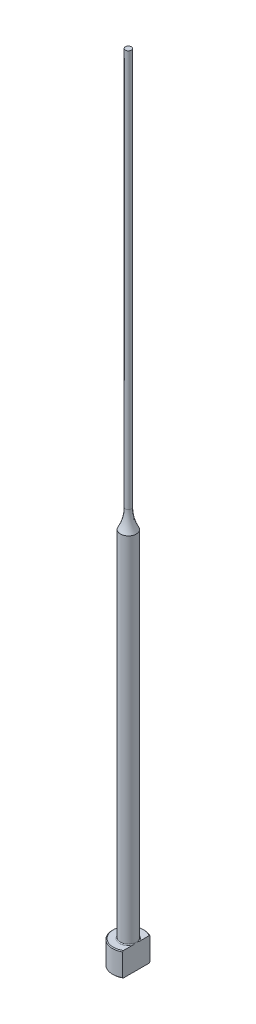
ISO-10303-21;
HEADER;
FILE_DESCRIPTION(('STEP AP214'),'2;1');
FILE_NAME('part.step','',(''),(''),'','','');
FILE_SCHEMA(('AUTOMOTIVE_DESIGN { 1 0 10303 214 1 1 1 1 }'));
ENDSEC;
DATA;
#1=APPLICATION_CONTEXT('core data for automotive mechanical design processes');
#2=APPLICATION_PROTOCOL_DEFINITION('international standard','automotive_design',2000,#1);
#3=PRODUCT_CONTEXT('',#1,'mechanical');
#4=PRODUCT('Part','Part','',(#3));
#5=PRODUCT_RELATED_PRODUCT_CATEGORY('part','',(#4));
#6=PRODUCT_DEFINITION_FORMATION('','',#4);
#7=PRODUCT_DEFINITION_CONTEXT('part definition',#1,'design');
#8=PRODUCT_DEFINITION('design','',#6,#7);
#9=PRODUCT_DEFINITION_SHAPE('','',#8);
#10=(LENGTH_UNIT() NAMED_UNIT(*) SI_UNIT(.MILLI.,.METRE.));
#11=(NAMED_UNIT(*) PLANE_ANGLE_UNIT() SI_UNIT($,.RADIAN.));
#12=(NAMED_UNIT(*) SI_UNIT($,.STERADIAN.) SOLID_ANGLE_UNIT());
#13=UNCERTAINTY_MEASURE_WITH_UNIT(LENGTH_MEASURE(1.E-05),#10,'distance_accuracy_value','');
#14=(GEOMETRIC_REPRESENTATION_CONTEXT(3) GLOBAL_UNCERTAINTY_ASSIGNED_CONTEXT((#13)) GLOBAL_UNIT_ASSIGNED_CONTEXT((#10,
#11,#12)) REPRESENTATION_CONTEXT('',''));
#15=CARTESIAN_POINT('',(0.,0.,0.));
#16=DIRECTION('',(0.,0.,1.));
#17=DIRECTION('',(1.,0.,0.));
#18=AXIS2_PLACEMENT_3D('',#15,#16,#17);
#19=CARTESIAN_POINT('',(-3.99999999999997,6.,0.));
#20=DIRECTION('',(0.,1.,0.));
#21=DIRECTION('',(0.,0.,1.));
#22=AXIS2_PLACEMENT_3D('',#19,#20,#21);
#23=PLANE('',#22);
#24=CARTESIAN_POINT('',(0.,6.,0.));
#25=DIRECTION('',(0.,1.,0.));
#26=DIRECTION('',(0.,0.,1.));
#27=AXIS2_PLACEMENT_3D('',#24,#25,#26);
#28=CIRCLE('',#27,3.80000000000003);
#29=CARTESIAN_POINT('',(1.99999999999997,6.,-3.23109888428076));
#30=VERTEX_POINT('',#29);
#31=CARTESIAN_POINT('',(1.99999999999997,6.,3.23109888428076));
#32=VERTEX_POINT('',#31);
#33=EDGE_CURVE('E187',#30,#32,#28,.T.);
#34=ORIENTED_EDGE('',*,*,#33,.T.);
#35=DIRECTION('',(0.,0.,-1.));
#36=VECTOR('',#35,1.);
#37=CARTESIAN_POINT('',(1.99999999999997,6.,0.));
#38=LINE('',#37,#36);
#39=CARTESIAN_POINT('',(1.99999999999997,5.99999999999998,0.916515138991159));
#40=VERTEX_POINT('',#39);
#41=EDGE_CURVE('E57',#32,#40,#38,.T.);
#42=ORIENTED_EDGE('',*,*,#41,.T.);
#43=CARTESIAN_POINT('',(0.,6.,0.));
#44=DIRECTION('',(0.,1.,0.));
#45=DIRECTION('',(0.,0.,1.));
#46=AXIS2_PLACEMENT_3D('',#43,#44,#45);
#47=CIRCLE('',#46,2.19999999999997);
#48=CARTESIAN_POINT('',(1.99999999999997,5.99999999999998,-0.916515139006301));
#49=VERTEX_POINT('',#48);
#50=EDGE_CURVE('E108',#40,#49,#47,.F.);
#51=ORIENTED_EDGE('',*,*,#50,.T.);
#52=EDGE_CURVE('E137',#49,#30,#38,.T.);
#53=ORIENTED_EDGE('',*,*,#52,.T.);
#54=EDGE_LOOP('',(#34,#42,#51,#53));
#55=FACE_BOUND('',#54,.T.);
#56=ADVANCED_FACE('F32',(#55),#23,.T.);
#57=CARTESIAN_POINT('',(0.,259.958771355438,0.));
#58=DIRECTION('',(0.,1.,0.));
#59=DIRECTION('',(0.,0.,1.));
#60=AXIS2_PLACEMENT_3D('',#57,#58,#59);
#61=CYLINDRICAL_SURFACE('',#60,3.99999999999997);
#62=CARTESIAN_POINT('',(0.,5.80000000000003,0.));
#63=DIRECTION('',(0.,1.,0.));
#64=DIRECTION('',(0.,0.,1.));
#65=AXIS2_PLACEMENT_3D('',#62,#63,#64);
#66=CIRCLE('',#65,3.99999999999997);
#67=CARTESIAN_POINT('',(1.99999999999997,5.80000000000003,3.46410161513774));
#68=VERTEX_POINT('',#67);
#69=CARTESIAN_POINT('',(1.99999999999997,5.80000000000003,-3.46410161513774));
#70=VERTEX_POINT('',#69);
#71=EDGE_CURVE('E105',#68,#70,#66,.F.);
#72=ORIENTED_EDGE('',*,*,#71,.T.);
#73=DIRECTION('',(0.,-1.,0.));
#74=VECTOR('',#73,1.);
#75=CARTESIAN_POINT('',(1.99999999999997,200.,-3.46410161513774));
#76=LINE('',#75,#74);
#77=CARTESIAN_POINT('',(1.99999999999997,0.199999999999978,-3.46410161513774));
#78=VERTEX_POINT('',#77);
#79=EDGE_CURVE('E193',#70,#78,#76,.T.);
#80=ORIENTED_EDGE('',*,*,#79,.T.);
#81=CARTESIAN_POINT('',(0.,0.199999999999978,0.));
#82=DIRECTION('',(0.,-1.,0.));
#83=DIRECTION('',(0.,0.,-1.));
#84=AXIS2_PLACEMENT_3D('',#81,#82,#83);
#85=CIRCLE('',#84,3.99999999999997);
#86=CARTESIAN_POINT('',(1.99999999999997,0.199999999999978,3.46410161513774));
#87=VERTEX_POINT('',#86);
#88=EDGE_CURVE('E100',#78,#87,#85,.F.);
#89=ORIENTED_EDGE('',*,*,#88,.T.);
#90=DIRECTION('',(0.,-1.,0.));
#91=VECTOR('',#90,1.);
#92=CARTESIAN_POINT('',(1.99999999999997,200.,3.46410161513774));
#93=LINE('',#92,#91);
#94=EDGE_CURVE('E93',#68,#87,#93,.T.);
#95=ORIENTED_EDGE('',*,*,#94,.F.);
#96=EDGE_LOOP('',(#72,#80,#89,#95));
#97=FACE_BOUND('',#96,.T.);
#98=ADVANCED_FACE('F158',(#97),#61,.T.);
#99=CARTESIAN_POINT('',(0.,0.,0.));
#100=DIRECTION('',(0.,-1.,0.));
#101=DIRECTION('',(0.,0.,-1.));
#102=AXIS2_PLACEMENT_3D('',#99,#100,#101);
#103=PLANE('',#102);
#104=CARTESIAN_POINT('',(0.,0.,0.));
#105=DIRECTION('',(0.,-1.,0.));
#106=DIRECTION('',(0.,0.,-1.));
#107=AXIS2_PLACEMENT_3D('',#104,#105,#106);
#108=CIRCLE('',#107,3.79999999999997);
#109=CARTESIAN_POINT('',(1.99999999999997,0.,3.23109888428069));
#110=VERTEX_POINT('',#109);
#111=CARTESIAN_POINT('',(1.99999999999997,0.,-3.23109888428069));
#112=VERTEX_POINT('',#111);
#113=EDGE_CURVE('E98',#110,#112,#108,.T.);
#114=ORIENTED_EDGE('',*,*,#113,.T.);
#115=DIRECTION('',(0.,0.,1.));
#116=VECTOR('',#115,1.);
#117=CARTESIAN_POINT('',(1.99999999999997,0.,3.46410161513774));
#118=LINE('',#117,#116);
#119=EDGE_CURVE('E83',#112,#110,#118,.T.);
#120=ORIENTED_EDGE('',*,*,#119,.T.);
#121=EDGE_LOOP('',(#114,#120));
#122=FACE_BOUND('',#121,.T.);
#123=ADVANCED_FACE('F103',(#122),#103,.T.);
#124=CARTESIAN_POINT('',(0.,6.00000000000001,0.));
#125=DIRECTION('',(0.,-1.,0.));
#126=DIRECTION('',(0.,0.,-1.));
#127=AXIS2_PLACEMENT_3D('',#124,#125,#126);
#128=CONICAL_SURFACE('',#127,3.80000000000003,0.785398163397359);
#129=ORIENTED_EDGE('',*,*,#71,.F.);
#130=CARTESIAN_POINT('',(1.99999999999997,1.91904532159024,7.62295524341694));
#131=CARTESIAN_POINT('',(1.99999999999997,2.08611243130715,7.4502239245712));
#132=CARTESIAN_POINT('',(1.99999999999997,2.25300024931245,7.27731861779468));
#133=CARTESIAN_POINT('',(1.99999999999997,2.58631125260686,6.93105655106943));
#134=CARTESIAN_POINT('',(1.99999999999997,2.75273443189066,6.75769978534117));
#135=CARTESIAN_POINT('',(1.99999999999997,3.08509080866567,6.41034692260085));
#136=CARTESIAN_POINT('',(1.99999999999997,3.25102371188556,6.23635054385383));
#137=CARTESIAN_POINT('',(1.99999999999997,3.58215598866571,5.88766284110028));
#138=CARTESIAN_POINT('',(1.99999999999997,3.74735536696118,5.71297152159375));
#139=CARTESIAN_POINT('',(1.99999999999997,4.0735385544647,5.36616839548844));
#140=CARTESIAN_POINT('',(1.99999999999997,4.23454099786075,5.19407412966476));
#141=CARTESIAN_POINT('',(1.99999999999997,4.55534102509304,4.8487666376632));
#142=CARTESIAN_POINT('',(1.99999999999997,4.71513861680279,4.67555341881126));
#143=CARTESIAN_POINT('',(1.99999999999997,5.0330618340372,4.32766569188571));
#144=CARTESIAN_POINT('',(1.99999999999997,5.19118781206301,4.15299150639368));
#145=CARTESIAN_POINT('',(1.99999999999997,5.50513944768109,3.80159134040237));
#146=CARTESIAN_POINT('',(1.99999999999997,5.66096519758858,3.62486544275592));
#147=CARTESIAN_POINT('',(1.99999999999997,5.90974646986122,3.33722425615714));
#148=CARTESIAN_POINT('',(1.99999999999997,6.00376148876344,3.22722645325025));
#149=CARTESIAN_POINT('',(1.99999999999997,6.19011825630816,3.00579987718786));
#150=CARTESIAN_POINT('',(1.99999999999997,6.28245983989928,2.89437096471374));
#151=CARTESIAN_POINT('',(1.99999999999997,6.46586188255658,2.66849662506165));
#152=CARTESIAN_POINT('',(1.99999999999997,6.55689849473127,2.5540317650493));
#153=CARTESIAN_POINT('',(1.99999999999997,6.73578809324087,2.32266819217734));
#154=CARTESIAN_POINT('',(1.99999999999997,6.82364184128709,2.20577007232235));
#155=CARTESIAN_POINT('',(1.99999999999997,6.99612756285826,1.96688707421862));
#156=CARTESIAN_POINT('',(1.99999999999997,7.08069035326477,1.84485190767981));
#157=CARTESIAN_POINT('',(1.99999999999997,7.24300264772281,1.59599329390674));
#158=CARTESIAN_POINT('',(1.99999999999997,7.32074277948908,1.46916359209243));
#159=CARTESIAN_POINT('',(1.99999999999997,7.42869763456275,1.27510066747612));
#160=CARTESIAN_POINT('',(1.99999999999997,7.46305374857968,1.21018943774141));
#161=CARTESIAN_POINT('',(1.99999999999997,7.52837146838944,1.07868835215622));
#162=CARTESIAN_POINT('',(1.99999999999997,7.55933245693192,1.01209819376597));
#163=CARTESIAN_POINT('',(1.99999999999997,7.6456686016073,0.809894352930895));
#164=CARTESIAN_POINT('',(1.99999999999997,7.69478214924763,0.671360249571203));
#165=CARTESIAN_POINT('',(1.99999999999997,7.74794829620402,0.463657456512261));
#166=CARTESIAN_POINT('',(1.99999999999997,7.76205065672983,0.397033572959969));
#167=CARTESIAN_POINT('',(1.99999999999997,7.78390371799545,0.262728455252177));
#168=CARTESIAN_POINT('',(1.99999999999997,7.79165498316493,0.195047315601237));
#169=CARTESIAN_POINT('',(1.99999999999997,7.80025690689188,0.0594528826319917));
#170=CARTESIAN_POINT('',(1.99999999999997,7.80112894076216,-0.00845903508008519));
#171=CARTESIAN_POINT('',(1.99999999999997,7.79596585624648,-0.144020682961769));
#172=CARTESIAN_POINT('',(1.99999999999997,7.78993016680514,-0.211670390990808));
#173=CARTESIAN_POINT('',(1.99999999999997,7.7714536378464,-0.345483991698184));
#174=CARTESIAN_POINT('',(1.99999999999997,7.75906777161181,-0.411655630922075));
#175=CARTESIAN_POINT('',(1.99999999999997,7.7286636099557,-0.542678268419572));
#176=CARTESIAN_POINT('',(1.99999999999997,7.7106446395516,-0.607529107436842));
#177=CARTESIAN_POINT('',(1.99999999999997,7.66972939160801,-0.73606439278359));
#178=CARTESIAN_POINT('',(1.99999999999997,7.64680564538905,-0.799739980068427));
#179=CARTESIAN_POINT('',(1.99999999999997,7.59700147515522,-0.925489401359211));
#180=CARTESIAN_POINT('',(1.99999999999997,7.57012185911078,-0.987563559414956));
#181=CARTESIAN_POINT('',(1.99999999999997,7.48443518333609,-1.17209020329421));
#182=CARTESIAN_POINT('',(1.99999999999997,7.42077407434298,-1.29228210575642));
#183=CARTESIAN_POINT('',(1.99999999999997,7.28502644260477,-1.52785770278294));
#184=CARTESIAN_POINT('',(1.99999999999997,7.21292931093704,-1.64323509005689));
#185=CARTESIAN_POINT('',(1.99999999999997,7.0628151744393,-1.87069387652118));
#186=CARTESIAN_POINT('',(1.99999999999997,6.98477595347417,-1.98276048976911));
#187=CARTESIAN_POINT('',(1.99999999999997,6.82481971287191,-2.20397837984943));
#188=CARTESIAN_POINT('',(1.99999999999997,6.74290465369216,-2.31313108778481));
#189=CARTESIAN_POINT('',(1.99999999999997,6.57517222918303,-2.53068545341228));
#190=CARTESIAN_POINT('',(1.99999999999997,6.48931769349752,-2.63905831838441));
#191=CARTESIAN_POINT('',(1.99999999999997,6.31548151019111,-2.85409686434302));
#192=CARTESIAN_POINT('',(1.99999999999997,6.22749963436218,-2.96076236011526));
#193=CARTESIAN_POINT('',(1.99999999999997,6.05015030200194,-3.17249211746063));
#194=CARTESIAN_POINT('',(1.99999999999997,5.96078672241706,-3.27755963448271));
#195=CARTESIAN_POINT('',(1.99999999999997,5.78082366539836,-3.48663191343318));
#196=CARTESIAN_POINT('',(1.99999999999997,5.69022416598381,-3.59063665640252));
#197=CARTESIAN_POINT('',(1.99999999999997,5.44796733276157,-3.86612439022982));
#198=CARTESIAN_POINT('',(1.99999999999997,5.29545972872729,-4.03685912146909));
#199=CARTESIAN_POINT('',(1.99999999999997,4.98858070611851,-4.3766480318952));
#200=CARTESIAN_POINT('',(1.99999999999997,4.83420923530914,-4.54570216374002));
#201=CARTESIAN_POINT('',(1.99999999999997,4.52396102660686,-4.882716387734));
#202=CARTESIAN_POINT('',(1.99999999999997,4.36808300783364,-5.05067529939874));
#203=CARTESIAN_POINT('',(1.99999999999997,4.05530513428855,-5.38563883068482));
#204=CARTESIAN_POINT('',(1.99999999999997,3.89840527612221,-5.55264344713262));
#205=CARTESIAN_POINT('',(1.99999999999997,3.59029018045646,-5.87905385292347));
#206=CARTESIAN_POINT('',(1.99999999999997,3.43910664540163,-6.03848959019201));
#207=CARTESIAN_POINT('',(1.99999999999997,3.13616436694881,-6.3568145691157));
#208=CARTESIAN_POINT('',(1.99999999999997,2.98440562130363,-6.51570380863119));
#209=CARTESIAN_POINT('',(1.99999999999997,2.68059501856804,-6.83286192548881));
#210=CARTESIAN_POINT('',(1.99999999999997,2.52854367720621,-6.99113129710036));
#211=CARTESIAN_POINT('',(1.99999999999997,2.22406035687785,-7.30730102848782));
#212=CARTESIAN_POINT('',(1.99999999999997,2.07162838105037,-7.46520139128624));
#213=CARTESIAN_POINT('',(1.99999999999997,1.91904532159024,-7.62295524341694));
#214=B_SPLINE_CURVE_WITH_KNOTS('',3,(#130,#131,#132,#133,#134,#135,#136,#137,#138,#139,#140,
#141,#142,#143,#144,#145,#146,#147,#148,#149,#150,#151,#152,#153,#154,#155,#156,#157,#158,#159,
#160,#161,#162,#163,#164,#165,#166,#167,#168,#169,#170,#171,#172,#173,#174,#175,#176,#177,#178,
#179,#180,#181,#182,#183,#184,#185,#186,#187,#188,#189,#190,#191,#192,#193,#194,#195,#196,#197,
#198,#199,#200,#201,#202,#203,#204,#205,#206,#207,#208,#209,#210,#211,#212,#213),.UNSPECIFIED.,
.F.,.F.,(4,2,2,2,2,2,2,2,2,2,2,2,2,2,2,2,2,2,2,2,2,2,2,2,2,2,2,2,2,2,2,2,2,2,2,2,2,2,2,2,2,4),
(0.,0.720921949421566,1.4418531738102,2.16315326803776,2.88444869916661,3.59144103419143,
4.29842874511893,5.00526427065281,5.71207135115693,6.14616174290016,6.58029471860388,
7.01901494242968,7.45762947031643,7.90290456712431,8.34878206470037,8.56901415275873,
8.78928621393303,9.22814472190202,9.43219512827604,9.63622739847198,9.83962544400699,
10.0430403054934,10.244723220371,10.4464303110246,10.6492980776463,10.8521244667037,
11.2595582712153,11.6675100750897,12.0770700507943,12.4864250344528,12.9011677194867,
13.3159550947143,13.7297367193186,14.1435257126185,14.8302935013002,15.5170805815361,
16.2045145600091,16.891950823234,17.5511045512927,18.2102608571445,18.8686819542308,
19.5270976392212),.UNSPECIFIED.);
#215=EDGE_CURVE('E136',#68,#32,#214,.T.);
#216=ORIENTED_EDGE('',*,*,#215,.T.);
#217=ORIENTED_EDGE('',*,*,#33,.F.);
#218=EDGE_CURVE('E128',#30,#70,#214,.T.);
#219=ORIENTED_EDGE('',*,*,#218,.T.);
#220=EDGE_LOOP('',(#129,#216,#217,#219));
#221=FACE_BOUND('',#220,.T.);
#222=ADVANCED_FACE('F144',(#221),#128,.T.);
#223=CARTESIAN_POINT('',(0.,0.199999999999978,0.));
#224=DIRECTION('',(0.,1.,0.));
#225=DIRECTION('',(0.,0.,1.));
#226=AXIS2_PLACEMENT_3D('',#223,#224,#225);
#227=CONICAL_SURFACE('',#226,3.99999999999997,0.785398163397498);
#228=ORIENTED_EDGE('',*,*,#88,.F.);
#229=CARTESIAN_POINT('',(1.99999999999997,4.08095467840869,-7.62295524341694));
#230=CARTESIAN_POINT('',(1.99999999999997,3.91388756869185,-7.45022392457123));
#231=CARTESIAN_POINT('',(1.99999999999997,3.74699975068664,-7.27731861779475));
#232=CARTESIAN_POINT('',(1.99999999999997,3.41368874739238,-6.93105655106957));
#233=CARTESIAN_POINT('',(1.99999999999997,3.24726556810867,-6.75769978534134));
#234=CARTESIAN_POINT('',(1.99999999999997,2.91490919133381,-6.4103469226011));
#235=CARTESIAN_POINT('',(1.99999999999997,2.748976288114,-6.23635054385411));
#236=CARTESIAN_POINT('',(1.99999999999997,2.41784401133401,-5.88766284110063));
#237=CARTESIAN_POINT('',(1.99999999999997,2.25264463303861,-5.71297152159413));
#238=CARTESIAN_POINT('',(1.99999999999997,1.92646144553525,-5.36616839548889));
#239=CARTESIAN_POINT('',(1.99999999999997,1.76545900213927,-5.19407412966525));
#240=CARTESIAN_POINT('',(1.99999999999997,1.44465897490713,-4.84876663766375));
#241=CARTESIAN_POINT('',(1.99999999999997,1.28486138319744,-4.67555341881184));
#242=CARTESIAN_POINT('',(1.99999999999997,0.966938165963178,-4.32766569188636));
#243=CARTESIAN_POINT('',(1.99999999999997,0.80881218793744,-4.15299150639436));
#244=CARTESIAN_POINT('',(1.99999999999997,0.494860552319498,-3.80159134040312));
#245=CARTESIAN_POINT('',(1.99999999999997,0.339034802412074,-3.62486544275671));
#246=CARTESIAN_POINT('',(1.99999999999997,0.0902535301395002,-3.33722425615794));
#247=CARTESIAN_POINT('',(1.99999999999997,-0.00376148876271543,-3.22722645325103));
#248=CARTESIAN_POINT('',(1.99999999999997,-0.190118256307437,-3.00579987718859));
#249=CARTESIAN_POINT('',(1.99999999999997,-0.282459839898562,-2.89437096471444));
#250=CARTESIAN_POINT('',(1.99999999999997,-0.465861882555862,-2.66849662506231));
#251=CARTESIAN_POINT('',(1.99999999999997,-0.556898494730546,-2.55403176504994));
#252=CARTESIAN_POINT('',(1.99999999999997,-0.735788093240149,-2.32266819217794));
#253=CARTESIAN_POINT('',(1.99999999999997,-0.823641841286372,-2.20577007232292));
#254=CARTESIAN_POINT('',(1.99999999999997,-0.996127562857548,-1.96688707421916));
#255=CARTESIAN_POINT('',(1.99999999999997,-1.08069035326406,-1.84485190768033));
#256=CARTESIAN_POINT('',(1.99999999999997,-1.24300264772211,-1.59599329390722));
#257=CARTESIAN_POINT('',(1.99999999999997,-1.32074277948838,-1.46916359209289));
#258=CARTESIAN_POINT('',(1.99999999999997,-1.42869763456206,-1.27510066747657));
#259=CARTESIAN_POINT('',(1.99999999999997,-1.46305374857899,-1.21018943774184));
#260=CARTESIAN_POINT('',(1.99999999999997,-1.52837146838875,-1.07868835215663));
#261=CARTESIAN_POINT('',(1.99999999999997,-1.55933245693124,-1.01209819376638));
#262=CARTESIAN_POINT('',(1.99999999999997,-1.64566860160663,-0.809894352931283));
#263=CARTESIAN_POINT('',(1.99999999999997,-1.69478214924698,-0.671360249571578));
#264=CARTESIAN_POINT('',(1.99999999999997,-1.7479482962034,-0.463657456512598));
#265=CARTESIAN_POINT('',(1.99999999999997,-1.76205065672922,-0.397033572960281));
#266=CARTESIAN_POINT('',(1.99999999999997,-1.78390371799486,-0.262728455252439));
#267=CARTESIAN_POINT('',(1.99999999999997,-1.79165498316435,-0.195047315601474));
#268=CARTESIAN_POINT('',(1.99999999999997,-1.80025690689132,-0.0594528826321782));
#269=CARTESIAN_POINT('',(1.99999999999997,-1.8011289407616,0.00845903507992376));
#270=CARTESIAN_POINT('',(1.99999999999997,-1.79596585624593,0.144020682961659));
#271=CARTESIAN_POINT('',(1.99999999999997,-1.78993016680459,0.211670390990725));
#272=CARTESIAN_POINT('',(1.99999999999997,-1.77145363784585,0.345483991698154));
#273=CARTESIAN_POINT('',(1.99999999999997,-1.75906777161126,0.41165563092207));
#274=CARTESIAN_POINT('',(1.99999999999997,-1.72866360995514,0.542678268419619));
#275=CARTESIAN_POINT('',(1.99999999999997,-1.71064463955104,0.607529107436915));
#276=CARTESIAN_POINT('',(1.99999999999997,-1.66972939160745,0.736064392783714));
#277=CARTESIAN_POINT('',(1.99999999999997,-1.64680564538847,0.799739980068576));
#278=CARTESIAN_POINT('',(1.99999999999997,-1.59700147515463,0.92548940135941));
#279=CARTESIAN_POINT('',(1.99999999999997,-1.57012185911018,0.987563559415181));
#280=CARTESIAN_POINT('',(1.99999999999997,-1.48443518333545,1.17209020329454));
#281=CARTESIAN_POINT('',(1.99999999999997,-1.4207740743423,1.29228210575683));
#282=CARTESIAN_POINT('',(1.99999999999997,-1.28502644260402,1.52785770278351));
#283=CARTESIAN_POINT('',(1.99999999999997,-1.21292931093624,1.64323509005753));
#284=CARTESIAN_POINT('',(1.99999999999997,-1.06281517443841,1.87069387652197));
#285=CARTESIAN_POINT('',(1.99999999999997,-0.984775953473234,1.98276048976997));
#286=CARTESIAN_POINT('',(1.99999999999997,-0.824819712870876,2.20397837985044));
#287=CARTESIAN_POINT('',(1.99999999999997,-0.742904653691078,2.31313108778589));
#288=CARTESIAN_POINT('',(1.99999999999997,-0.575172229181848,2.5306854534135));
#289=CARTESIAN_POINT('',(1.99999999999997,-0.489317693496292,2.6390583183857));
#290=CARTESIAN_POINT('',(1.99999999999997,-0.315481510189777,2.85409686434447));
#291=CARTESIAN_POINT('',(1.99999999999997,-0.227499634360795,2.96076236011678));
#292=CARTESIAN_POINT('',(1.99999999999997,-0.0501503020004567,3.1724921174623));
#293=CARTESIAN_POINT('',(1.99999999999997,0.0392132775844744,3.27755963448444));
#294=CARTESIAN_POINT('',(1.99999999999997,0.219176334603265,3.48663191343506));
#295=CARTESIAN_POINT('',(1.99999999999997,0.309775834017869,3.59063665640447));
#296=CARTESIAN_POINT('',(1.99999999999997,0.552032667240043,3.86612439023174));
#297=CARTESIAN_POINT('',(1.99999999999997,0.704540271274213,4.03685912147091));
#298=CARTESIAN_POINT('',(1.99999999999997,1.01141929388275,4.37664803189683));
#299=CARTESIAN_POINT('',(1.99999999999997,1.16579076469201,4.54570216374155));
#300=CARTESIAN_POINT('',(1.99999999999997,1.47603897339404,4.88271638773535));
#301=CARTESIAN_POINT('',(1.99999999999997,1.63191699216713,5.05067529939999));
#302=CARTESIAN_POINT('',(1.99999999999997,1.94469486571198,5.38563883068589));
#303=CARTESIAN_POINT('',(1.99999999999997,2.10159472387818,5.5526434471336));
#304=CARTESIAN_POINT('',(1.99999999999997,2.40970981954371,5.87905385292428));
#305=CARTESIAN_POINT('',(1.99999999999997,2.56089335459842,6.03848959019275));
#306=CARTESIAN_POINT('',(1.99999999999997,2.86383563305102,6.35681456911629));
#307=CARTESIAN_POINT('',(1.99999999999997,3.01559437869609,6.5157038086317));
#308=CARTESIAN_POINT('',(1.99999999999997,3.31940498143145,6.83286192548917));
#309=CARTESIAN_POINT('',(1.99999999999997,3.47145632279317,6.99113129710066));
#310=CARTESIAN_POINT('',(1.99999999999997,3.7759396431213,7.30730102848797));
#311=CARTESIAN_POINT('',(1.99999999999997,3.92837161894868,7.46520139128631));
#312=CARTESIAN_POINT('',(1.99999999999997,4.08095467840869,7.62295524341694));
#313=B_SPLINE_CURVE_WITH_KNOTS('',3,(#229,#230,#231,#232,#233,#234,#235,#236,#237,#238,#239,
#240,#241,#242,#243,#244,#245,#246,#247,#248,#249,#250,#251,#252,#253,#254,#255,#256,#257,#258,
#259,#260,#261,#262,#263,#264,#265,#266,#267,#268,#269,#270,#271,#272,#273,#274,#275,#276,#277,
#278,#279,#280,#281,#282,#283,#284,#285,#286,#287,#288,#289,#290,#291,#292,#293,#294,#295,#296,
#297,#298,#299,#300,#301,#302,#303,#304,#305,#306,#307,#308,#309,#310,#311,#312),.UNSPECIFIED.,
.F.,.F.,(4,2,2,2,2,2,2,2,2,2,2,2,2,2,2,2,2,2,2,2,2,2,2,2,2,2,2,2,2,2,2,2,2,2,2,2,2,2,2,2,2,4),
(0.,0.720921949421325,1.44185317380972,2.16315326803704,2.88444869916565,3.59144103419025,
4.29842874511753,5.0052642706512,5.71207135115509,6.14616174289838,6.58029471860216,
7.01901494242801,7.45762947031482,7.90290456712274,8.34878206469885,8.56901415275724,
8.78928621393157,9.22814472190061,9.43219512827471,9.63622739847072,9.83962544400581,
10.0430403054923,10.24472322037,10.4464303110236,10.6492980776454,10.852124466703,
11.2595582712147,11.6675100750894,12.0770700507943,12.4864250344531,12.9011677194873,
13.3159550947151,13.7297367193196,14.1435257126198,14.8302935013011,15.5170805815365,
16.204514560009,16.8919508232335,17.5511045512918,18.2102608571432,18.8686819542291,
19.5270976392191),.UNSPECIFIED.);
#314=EDGE_CURVE('E86',#78,#112,#313,.T.);
#315=ORIENTED_EDGE('',*,*,#314,.T.);
#316=ORIENTED_EDGE('',*,*,#113,.F.);
#317=EDGE_CURVE('E89',#110,#87,#313,.T.);
#318=ORIENTED_EDGE('',*,*,#317,.T.);
#319=EDGE_LOOP('',(#228,#315,#316,#318));
#320=FACE_BOUND('',#319,.T.);
#321=ADVANCED_FACE('F97',(#320),#227,.T.);
#322=CARTESIAN_POINT('',(0.,6.19999999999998,0.));
#323=DIRECTION('',(0.,1.,0.));
#324=DIRECTION('',(0.,0.,1.));
#325=AXIS2_PLACEMENT_3D('',#322,#323,#324);
#326=TOROIDAL_SURFACE('',#325,2.19999999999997,0.2);
#327=CARTESIAN_POINT('',(1.99999999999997,6.19999999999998,0.));
#328=CARTESIAN_POINT('',(1.99999999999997,6.20000050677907,1.13930197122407E-10));
#329=CARTESIAN_POINT('',(1.99999999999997,6.20000101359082,-1.46766795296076E-07));
#330=CARTESIAN_POINT('',(1.99999999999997,6.20000197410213,-5.82067450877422E-07));
#331=CARTESIAN_POINT('',(1.99999999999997,6.20000242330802,-8.77873017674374E-07));
#332=CARTESIAN_POINT('',(1.99999999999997,6.2000033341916,-1.58424515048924E-06));
#333=CARTESIAN_POINT('',(1.99999999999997,6.20000378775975,-2.00534283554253E-06));
#334=CARTESIAN_POINT('',(1.99999999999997,6.20000462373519,-2.89558841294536E-06));
#335=CARTESIAN_POINT('',(1.99999999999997,6.20000500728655,-3.36372325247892E-06));
#336=CARTESIAN_POINT('',(1.99999999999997,6.20000636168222,-5.10887550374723E-06));
#337=CARTESIAN_POINT('',(1.99999999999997,6.20000725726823,-6.44597279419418E-06));
#338=CARTESIAN_POINT('',(1.99999999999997,6.20000879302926,-9.14926716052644E-06));
#339=CARTESIAN_POINT('',(1.99999999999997,6.20000944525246,-1.05089714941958E-05));
#340=CARTESIAN_POINT('',(1.99999999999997,6.20001204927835,-1.60555880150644E-05));
#341=CARTESIAN_POINT('',(1.99999999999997,6.20001390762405,-2.02908747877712E-05));
#342=CARTESIAN_POINT('',(1.99999999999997,6.20001676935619,-2.8443849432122E-05));
#343=CARTESIAN_POINT('',(1.99999999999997,6.20001785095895,-3.23343259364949E-05));
#344=CARTESIAN_POINT('',(1.99999999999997,6.20002551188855,-6.06027145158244E-05));
#345=CARTESIAN_POINT('',(1.99999999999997,6.20003111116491,-8.51991847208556E-05));
#346=CARTESIAN_POINT('',(1.99999999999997,6.20005559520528,-0.000181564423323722));
#347=CARTESIAN_POINT('',(1.99999999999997,6.20007914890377,-0.000252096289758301));
#348=CARTESIAN_POINT('',(1.99999999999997,6.20017002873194,-0.000529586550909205));
#349=CARTESIAN_POINT('',(1.99999999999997,6.20023415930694,-0.000737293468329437));
#350=CARTESIAN_POINT('',(1.99999999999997,6.20048926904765,-0.00155657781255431));
#351=CARTESIAN_POINT('',(1.99999999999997,6.2006841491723,-0.00216722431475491));
#352=CARTESIAN_POINT('',(1.99999999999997,6.20148805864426,-0.00469384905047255));
#353=CARTESIAN_POINT('',(1.99999999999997,6.20209226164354,-0.00661098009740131));
#354=CARTESIAN_POINT('',(1.99999999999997,6.20822779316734,-0.0260695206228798));
#355=CARTESIAN_POINT('',(1.99999999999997,6.21378174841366,-0.0436057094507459));
#356=CARTESIAN_POINT('',(1.99999999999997,6.22462834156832,-0.0780127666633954));
#357=CARTESIAN_POINT('',(1.99999999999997,6.22992277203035,-0.0948831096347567));
#358=CARTESIAN_POINT('',(1.99999999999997,6.24110477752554,-0.130713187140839));
#359=CARTESIAN_POINT('',(1.99999999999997,6.24698536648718,-0.149675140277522));
#360=CARTESIAN_POINT('',(1.99999999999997,6.25869835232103,-0.187834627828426));
#361=CARTESIAN_POINT('',(1.99999999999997,6.26452957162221,-0.20703252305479));
#362=CARTESIAN_POINT('',(1.99999999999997,6.27861584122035,-0.254071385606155));
#363=CARTESIAN_POINT('',(1.99999999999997,6.28678835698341,-0.281937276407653));
#364=CARTESIAN_POINT('',(1.99999999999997,6.30249503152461,-0.33711523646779));
#365=CARTESIAN_POINT('',(1.99999999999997,6.31003989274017,-0.364424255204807));
#366=CARTESIAN_POINT('',(1.99999999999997,6.32554795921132,-0.422841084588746));
#367=CARTESIAN_POINT('',(1.99999999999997,6.33343288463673,-0.453970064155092));
#368=CARTESIAN_POINT('',(1.99999999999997,6.34833120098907,-0.516667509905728));
#369=CARTESIAN_POINT('',(1.99999999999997,6.3553379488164,-0.548237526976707));
#370=CARTESIAN_POINT('',(1.99999999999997,6.37554978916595,-0.647984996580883));
#371=CARTESIAN_POINT('',(1.99999999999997,6.38665117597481,-0.716635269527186));
#372=CARTESIAN_POINT('',(1.99999999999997,6.39785773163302,-0.8324457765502));
#373=CARTESIAN_POINT('',(1.99999999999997,6.40036304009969,-0.879345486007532));
#374=CARTESIAN_POINT('',(1.99999999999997,6.39976024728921,-0.949238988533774));
#375=CARTESIAN_POINT('',(1.99999999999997,6.39886048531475,-0.97224857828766));
#376=CARTESIAN_POINT('',(1.99999999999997,6.39534463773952,-1.01812773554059));
#377=CARTESIAN_POINT('',(1.99999999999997,6.39273014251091,-1.04099741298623));
#378=CARTESIAN_POINT('',(1.99999999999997,6.38623968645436,-1.08102660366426));
#379=CARTESIAN_POINT('',(1.99999999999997,6.38280841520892,-1.09825717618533));
#380=CARTESIAN_POINT('',(1.99999999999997,6.37442567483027,-1.13243508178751));
#381=CARTESIAN_POINT('',(1.99999999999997,6.36946777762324,-1.14938089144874));
#382=CARTESIAN_POINT('',(1.99999999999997,6.35764172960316,-1.18276398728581));
#383=CARTESIAN_POINT('',(1.99999999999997,6.35075810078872,-1.1991959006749));
#384=CARTESIAN_POINT('',(1.99999999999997,6.33462082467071,-1.23083581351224));
#385=CARTESIAN_POINT('',(1.99999999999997,6.32537783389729,-1.24604892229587));
#386=CARTESIAN_POINT('',(1.99999999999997,6.30929159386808,-1.26715296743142));
#387=CARTESIAN_POINT('',(1.99999999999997,6.303567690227,-1.27389441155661));
#388=CARTESIAN_POINT('',(1.99999999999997,6.29128925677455,-1.28659894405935));
#389=CARTESIAN_POINT('',(1.99999999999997,6.28473413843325,-1.29256147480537));
#390=CARTESIAN_POINT('',(1.99999999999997,6.27066594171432,-1.30346436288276));
#391=CARTESIAN_POINT('',(1.99999999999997,6.26314132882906,-1.30839014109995));
#392=CARTESIAN_POINT('',(1.99999999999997,6.24727957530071,-1.31668687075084));
#393=CARTESIAN_POINT('',(1.99999999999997,6.23894498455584,-1.32006252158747));
#394=CARTESIAN_POINT('',(1.99999999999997,6.22424089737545,-1.3241557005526));
#395=CARTESIAN_POINT('',(1.99999999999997,6.21800630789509,-1.32536112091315));
#396=CARTESIAN_POINT('',(1.99999999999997,6.2054226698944,-1.32669615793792));
#397=CARTESIAN_POINT('',(1.99999999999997,6.19907368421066,-1.32682634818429));
#398=CARTESIAN_POINT('',(1.99999999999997,6.18645152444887,-1.32599950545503));
#399=CARTESIAN_POINT('',(1.99999999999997,6.18017831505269,-1.32504300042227));
#400=CARTESIAN_POINT('',(1.99999999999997,6.16787181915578,-1.32212308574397));
#401=CARTESIAN_POINT('',(1.99999999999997,6.16183869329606,-1.32015901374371));
#402=CARTESIAN_POINT('',(1.99999999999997,6.14844260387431,-1.31466566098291));
#403=CARTESIAN_POINT('',(1.99999999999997,6.14119825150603,-1.3108482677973));
#404=CARTESIAN_POINT('',(1.99999999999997,6.12742328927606,-1.30209252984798));
#405=CARTESIAN_POINT('',(1.99999999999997,6.12089414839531,-1.29715193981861));
#406=CARTESIAN_POINT('',(1.99999999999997,6.10554761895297,-1.28382084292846));
#407=CARTESIAN_POINT('',(1.99999999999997,6.09717242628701,-1.27492468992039));
#408=CARTESIAN_POINT('',(1.99999999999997,6.08188323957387,-1.25597903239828));
#409=CARTESIAN_POINT('',(1.99999999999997,6.07497120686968,-1.24592800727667));
#410=CARTESIAN_POINT('',(1.99999999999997,6.05771073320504,-1.21734573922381));
#411=CARTESIAN_POINT('',(1.99999999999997,6.04862251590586,-1.19806017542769));
#412=CARTESIAN_POINT('',(1.99999999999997,6.03323781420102,-1.15830155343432));
#413=CARTESIAN_POINT('',(1.99999999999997,6.02696471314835,-1.13782009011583));
#414=CARTESIAN_POINT('',(1.99999999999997,6.01659159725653,-1.09607450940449));
#415=CARTESIAN_POINT('',(1.99999999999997,6.01251776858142,-1.07480405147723));
#416=CARTESIAN_POINT('',(1.99999999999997,6.0061890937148,-1.03196822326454));
#417=CARTESIAN_POINT('',(1.99999999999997,6.00393768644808,-1.0104023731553));
#418=CARTESIAN_POINT('',(1.99999999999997,5.99950887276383,-0.946948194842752));
#419=CARTESIAN_POINT('',(1.99999999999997,5.99937097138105,-0.904921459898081));
#420=CARTESIAN_POINT('',(1.99999999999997,6.00391139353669,-0.800067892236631));
#421=CARTESIAN_POINT('',(1.99999999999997,6.01103947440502,-0.737378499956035));
#422=CARTESIAN_POINT('',(1.99999999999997,6.0310998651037,-0.611444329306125));
#423=CARTESIAN_POINT('',(1.99999999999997,6.04417074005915,-0.548223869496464));
#424=CARTESIAN_POINT('',(1.99999999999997,6.06920011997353,-0.442888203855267));
#425=CARTESIAN_POINT('',(1.99999999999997,6.08016343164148,-0.400527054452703));
#426=CARTESIAN_POINT('',(1.99999999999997,6.10315303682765,-0.316588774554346));
#427=CARTESIAN_POINT('',(1.99999999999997,6.11516655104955,-0.275008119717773));
#428=CARTESIAN_POINT('',(1.99999999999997,6.13853403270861,-0.196672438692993));
#429=CARTESIAN_POINT('',(1.99999999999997,6.14981294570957,-0.159894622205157));
#430=CARTESIAN_POINT('',(1.99999999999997,6.17316886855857,-0.0849211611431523));
#431=CARTESIAN_POINT('',(1.99999999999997,6.18525959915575,-0.0467297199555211));
#432=CARTESIAN_POINT('',(1.99999999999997,6.19790869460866,-0.00660765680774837));
#433=CARTESIAN_POINT('',(1.99999999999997,6.19851400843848,-0.00468723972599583));
#434=CARTESIAN_POINT('',(1.99999999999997,6.19931818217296,-0.00215985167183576));
#435=CARTESIAN_POINT('',(1.99999999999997,6.19951225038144,-0.00155173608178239));
#436=CARTESIAN_POINT('',(1.99999999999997,6.19976637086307,-0.000735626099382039));
#437=CARTESIAN_POINT('',(1.99999999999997,6.19983030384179,-0.000528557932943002));
#438=CARTESIAN_POINT('',(1.99999999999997,6.19992094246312,-0.000251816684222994));
#439=CARTESIAN_POINT('',(1.99999999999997,6.19994446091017,-0.000181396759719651));
#440=CARTESIAN_POINT('',(1.99999999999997,6.19996891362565,-8.516223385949E-05));
#441=CARTESIAN_POINT('',(1.99999999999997,6.19997450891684,-6.05824645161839E-05));
#442=CARTESIAN_POINT('',(1.99999999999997,6.19998216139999,-3.23308902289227E-05));
#443=CARTESIAN_POINT('',(1.99999999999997,6.19998324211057,-2.84414359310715E-05));
#444=CARTESIAN_POINT('',(1.99999999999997,6.19998610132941,-2.02904710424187E-05));
#445=CARTESIAN_POINT('',(1.99999999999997,6.19998795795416,-1.60561198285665E-05));
#446=CARTESIAN_POINT('',(1.99999999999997,6.19999055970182,-1.05104411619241E-05));
#447=CARTESIAN_POINT('',(1.99999999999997,6.19999121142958,-9.15081316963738E-06));
#448=CARTESIAN_POINT('',(1.99999999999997,6.1999927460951,-6.44758195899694E-06));
#449=CARTESIAN_POINT('',(1.99999999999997,6.19999364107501,-5.11046373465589E-06));
#450=CARTESIAN_POINT('',(1.99999999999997,6.19999499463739,-3.36517635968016E-06));
#451=CARTESIAN_POINT('',(1.99999999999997,6.19999537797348,-2.89697955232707E-06));
#452=CARTESIAN_POINT('',(1.99999999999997,6.19999621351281,-2.00657125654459E-06));
#453=CARTESIAN_POINT('',(1.99999999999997,6.19999666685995,-1.58537196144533E-06));
#454=CARTESIAN_POINT('',(1.99999999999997,6.19999757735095,-8.78757217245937E-07));
#455=CARTESIAN_POINT('',(1.99999999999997,6.19999802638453,-5.82817893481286E-07));
#456=CARTESIAN_POINT('',(1.99999999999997,6.19999898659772,-1.4718673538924E-07));
#457=CARTESIAN_POINT('',(1.99999999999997,6.19999949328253,-1.13916340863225E-10));
#458=CARTESIAN_POINT('',(1.99999999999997,6.19999999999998,0.));
#459=B_SPLINE_CURVE_WITH_KNOTS('',3,(#327,#328,#329,#330,#331,#332,#333,#334,#335,#336,#337,
#338,#339,#340,#341,#342,#343,#344,#345,#346,#347,#348,#349,#350,#351,#352,#353,#354,#355,#356,
#357,#358,#359,#360,#361,#362,#363,#364,#365,#366,#367,#368,#369,#370,#371,#372,#373,#374,#375,
#376,#377,#378,#379,#380,#381,#382,#383,#384,#385,#386,#387,#388,#389,#390,#391,#392,#393,#394,
#395,#396,#397,#398,#399,#400,#401,#402,#403,#404,#405,#406,#407,#408,#409,#410,#411,#412,#413,
#414,#415,#416,#417,#418,#419,#420,#421,#422,#423,#424,#425,#426,#427,#428,#429,#430,#431,#432,
#433,#434,#435,#436,#437,#438,#439,#440,#441,#442,#443,#444,#445,#446,#447,#448,#449,#450,#451,
#452,#453,#454,#455,#456,#457,#458),.UNSPECIFIED.,.T.,.F.,(4,2,2,2,2,2,2,2,2,2,2,2,2,2,2,2,2,2,
2,2,2,2,2,2,2,2,2,2,2,2,2,2,2,2,2,2,2,2,2,2,2,2,2,2,2,2,2,2,2,2,2,2,2,2,2,2,2,2,2,2,2,2,2,2,2,
4),(0.,1.52369882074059E-06,3.13175174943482E-06,4.97933869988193E-06,6.79332712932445E-06,
1.16005918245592E-05,1.61211188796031E-05,2.99630984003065E-05,4.20611839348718E-05,
0.000117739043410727,0.000340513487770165,0.000992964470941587,0.00291555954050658,
0.00894623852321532,0.0641278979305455,0.117173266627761,0.176731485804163,0.236923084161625,
0.324038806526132,0.409031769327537,0.505353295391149,0.602364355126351,0.810598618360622,
0.951214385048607,1.02024793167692,1.08921754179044,1.14187257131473,1.19475241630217,
1.24807013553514,1.30115116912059,1.32762610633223,1.35411989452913,1.38096446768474,
1.40772711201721,1.42669285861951,1.44564848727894,1.46459491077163,1.48355380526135,
1.50798338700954,1.53246223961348,1.56891061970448,1.60540755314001,1.66900939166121,
1.73313017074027,1.7979984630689,1.86298887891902,1.98877684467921,2.17764082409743,
2.37115413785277,2.50240556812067,2.63223743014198,2.74764208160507,2.86781494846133,
2.87385601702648,2.87577064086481,2.87642108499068,2.87664350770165,2.87671913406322,
2.87673122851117,2.87674506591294,2.87674958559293,2.87675439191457,2.87675620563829,
2.87675805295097,2.87675966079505,2.87676118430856),.UNSPECIFIED.);
#460=CARTESIAN_POINT('',(1.99999999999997,6.19999999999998,0.));
#461=VERTEX_POINT('',#460);
#462=EDGE_CURVE('E11',#49,#461,#459,.T.);
#463=ORIENTED_EDGE('',*,*,#462,.F.);
#464=ORIENTED_EDGE('',*,*,#50,.F.);
#465=CARTESIAN_POINT('',(1.99999999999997,6.19999999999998,0.));
#466=CARTESIAN_POINT('',(1.99999999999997,6.19999949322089,-1.13930196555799E-10));
#467=CARTESIAN_POINT('',(1.99999999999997,6.19999898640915,1.4676679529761E-07));
#468=CARTESIAN_POINT('',(1.99999999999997,6.19999802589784,5.82067450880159E-07));
#469=CARTESIAN_POINT('',(1.99999999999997,6.19999757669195,8.77873017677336E-07));
#470=CARTESIAN_POINT('',(1.99999999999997,6.19999666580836,1.58424515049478E-06));
#471=CARTESIAN_POINT('',(1.99999999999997,6.19999621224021,2.00534283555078E-06));
#472=CARTESIAN_POINT('',(1.99999999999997,6.19999537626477,2.89558841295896E-06));
#473=CARTESIAN_POINT('',(1.99999999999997,6.19999499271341,3.3637232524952E-06));
#474=CARTESIAN_POINT('',(1.99999999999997,6.19999363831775,5.10887550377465E-06));
#475=CARTESIAN_POINT('',(1.99999999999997,6.19999274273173,6.44597279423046E-06));
#476=CARTESIAN_POINT('',(1.99999999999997,6.1999912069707,9.14926716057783E-06));
#477=CARTESIAN_POINT('',(1.99999999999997,6.19999055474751,1.05089714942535E-05));
#478=CARTESIAN_POINT('',(1.99999999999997,6.19998795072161,1.60555880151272E-05));
#479=CARTESIAN_POINT('',(1.99999999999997,6.19998609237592,2.02908747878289E-05));
#480=CARTESIAN_POINT('',(1.99999999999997,6.19998323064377,2.84438494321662E-05));
#481=CARTESIAN_POINT('',(1.99999999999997,6.19998214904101,3.23343259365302E-05));
#482=CARTESIAN_POINT('',(1.99999999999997,6.19997448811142,6.06027145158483E-05));
#483=CARTESIAN_POINT('',(1.99999999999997,6.19996888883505,8.51991847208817E-05));
#484=CARTESIAN_POINT('',(1.99999999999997,6.19994440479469,0.000181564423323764));
#485=CARTESIAN_POINT('',(1.99999999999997,6.1999208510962,0.000252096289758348));
#486=CARTESIAN_POINT('',(1.99999999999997,6.19982997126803,0.000529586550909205));
#487=CARTESIAN_POINT('',(1.99999999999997,6.19976584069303,0.000737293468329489));
#488=CARTESIAN_POINT('',(1.99999999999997,6.19951073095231,0.00155657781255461));
#489=CARTESIAN_POINT('',(1.99999999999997,6.19931585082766,0.00216722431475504));
#490=CARTESIAN_POINT('',(1.99999999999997,6.1985119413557,0.00469384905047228));
#491=CARTESIAN_POINT('',(1.99999999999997,6.19790773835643,0.00661098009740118));
#492=CARTESIAN_POINT('',(1.99999999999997,6.19177220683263,0.0260695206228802));
#493=CARTESIAN_POINT('',(1.99999999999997,6.18621825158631,0.0436057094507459));
#494=CARTESIAN_POINT('',(1.99999999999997,6.17537165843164,0.0780127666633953));
#495=CARTESIAN_POINT('',(1.99999999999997,6.17007722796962,0.0948831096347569));
#496=CARTESIAN_POINT('',(1.99999999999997,6.15889522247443,0.130713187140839));
#497=CARTESIAN_POINT('',(1.99999999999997,6.15301463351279,0.149675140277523));
#498=CARTESIAN_POINT('',(1.99999999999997,6.14130164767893,0.187834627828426));
#499=CARTESIAN_POINT('',(1.99999999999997,6.13547042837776,0.20703252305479));
#500=CARTESIAN_POINT('',(1.99999999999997,6.12138415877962,0.254071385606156));
#501=CARTESIAN_POINT('',(1.99999999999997,6.11321164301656,0.281937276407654));
#502=CARTESIAN_POINT('',(1.99999999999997,6.09750496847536,0.337115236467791));
#503=CARTESIAN_POINT('',(1.99999999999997,6.0899601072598,0.364424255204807));
#504=CARTESIAN_POINT('',(1.99999999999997,6.07445204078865,0.422841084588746));
#505=CARTESIAN_POINT('',(1.99999999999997,6.06656711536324,0.453970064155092));
#506=CARTESIAN_POINT('',(1.99999999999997,6.0516687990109,0.516667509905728));
#507=CARTESIAN_POINT('',(1.99999999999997,6.04466205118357,0.548237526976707));
#508=CARTESIAN_POINT('',(1.99999999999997,6.02445021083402,0.647984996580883));
#509=CARTESIAN_POINT('',(1.99999999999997,6.01334882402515,0.716635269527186));
#510=CARTESIAN_POINT('',(1.99999999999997,6.00214226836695,0.8324457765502));
#511=CARTESIAN_POINT('',(1.99999999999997,5.99963695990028,0.879345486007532));
#512=CARTESIAN_POINT('',(1.99999999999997,6.00023975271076,0.949238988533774));
#513=CARTESIAN_POINT('',(1.99999999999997,6.00113951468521,0.97224857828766));
#514=CARTESIAN_POINT('',(1.99999999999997,6.00465536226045,1.01812773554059));
#515=CARTESIAN_POINT('',(1.99999999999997,6.00726985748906,1.04099741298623));
#516=CARTESIAN_POINT('',(1.99999999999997,6.01376031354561,1.08102660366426));
#517=CARTESIAN_POINT('',(1.99999999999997,6.01719158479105,1.09825717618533));
#518=CARTESIAN_POINT('',(1.99999999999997,6.02557432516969,1.13243508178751));
#519=CARTESIAN_POINT('',(1.99999999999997,6.03053222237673,1.14938089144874));
#520=CARTESIAN_POINT('',(1.99999999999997,6.04235827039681,1.18276398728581));
#521=CARTESIAN_POINT('',(1.99999999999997,6.04924189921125,1.1991959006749));
#522=CARTESIAN_POINT('',(1.99999999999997,6.06537917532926,1.23083581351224));
#523=CARTESIAN_POINT('',(1.99999999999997,6.07462216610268,1.24604892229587));
#524=CARTESIAN_POINT('',(1.99999999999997,6.09070840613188,1.26715296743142));
#525=CARTESIAN_POINT('',(1.99999999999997,6.09643230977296,1.27389441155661));
#526=CARTESIAN_POINT('',(1.99999999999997,6.10871074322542,1.28659894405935));
#527=CARTESIAN_POINT('',(1.99999999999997,6.11526586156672,1.29256147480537));
#528=CARTESIAN_POINT('',(1.99999999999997,6.12933405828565,1.30346436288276));
#529=CARTESIAN_POINT('',(1.99999999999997,6.1368586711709,1.30839014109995));
#530=CARTESIAN_POINT('',(1.99999999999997,6.15272042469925,1.31668687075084));
#531=CARTESIAN_POINT('',(1.99999999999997,6.16105501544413,1.32006252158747));
#532=CARTESIAN_POINT('',(1.99999999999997,6.17575910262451,1.3241557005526));
#533=CARTESIAN_POINT('',(1.99999999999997,6.18199369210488,1.32536112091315));
#534=CARTESIAN_POINT('',(1.99999999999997,6.19457733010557,1.32669615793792));
#535=CARTESIAN_POINT('',(1.99999999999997,6.20092631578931,1.32682634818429));
#536=CARTESIAN_POINT('',(1.99999999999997,6.2135484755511,1.32599950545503));
#537=CARTESIAN_POINT('',(1.99999999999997,6.21982168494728,1.32504300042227));
#538=CARTESIAN_POINT('',(1.99999999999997,6.23212818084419,1.32212308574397));
#539=CARTESIAN_POINT('',(1.99999999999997,6.23816130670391,1.32015901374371));
#540=CARTESIAN_POINT('',(1.99999999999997,6.25155739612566,1.31466566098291));
#541=CARTESIAN_POINT('',(1.99999999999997,6.25880174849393,1.3108482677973));
#542=CARTESIAN_POINT('',(1.99999999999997,6.2725767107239,1.30209252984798));
#543=CARTESIAN_POINT('',(1.99999999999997,6.27910585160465,1.29715193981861));
#544=CARTESIAN_POINT('',(1.99999999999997,6.29445238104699,1.28382084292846));
#545=CARTESIAN_POINT('',(1.99999999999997,6.30282757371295,1.27492468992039));
#546=CARTESIAN_POINT('',(1.99999999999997,6.3181167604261,1.25597903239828));
#547=CARTESIAN_POINT('',(1.99999999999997,6.32502879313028,1.24592800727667));
#548=CARTESIAN_POINT('',(1.99999999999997,6.34228926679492,1.21734573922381));
#549=CARTESIAN_POINT('',(1.99999999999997,6.35137748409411,1.19806017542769));
#550=CARTESIAN_POINT('',(1.99999999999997,6.36676218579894,1.15830155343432));
#551=CARTESIAN_POINT('',(1.99999999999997,6.37303528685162,1.13782009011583));
#552=CARTESIAN_POINT('',(1.99999999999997,6.38340840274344,1.09607450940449));
#553=CARTESIAN_POINT('',(1.99999999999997,6.38748223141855,1.07480405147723));
#554=CARTESIAN_POINT('',(1.99999999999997,6.39381090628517,1.03196822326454));
#555=CARTESIAN_POINT('',(1.99999999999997,6.39606231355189,1.0104023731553));
#556=CARTESIAN_POINT('',(1.99999999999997,6.40049112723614,0.946948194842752));
#557=CARTESIAN_POINT('',(1.99999999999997,6.40062902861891,0.904921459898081));
#558=CARTESIAN_POINT('',(1.99999999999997,6.39608860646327,0.800067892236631));
#559=CARTESIAN_POINT('',(1.99999999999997,6.38896052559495,0.737378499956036));
#560=CARTESIAN_POINT('',(1.99999999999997,6.36890013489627,0.611444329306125));
#561=CARTESIAN_POINT('',(1.99999999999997,6.35582925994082,0.548223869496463));
#562=CARTESIAN_POINT('',(1.99999999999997,6.33079988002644,0.442888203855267));
#563=CARTESIAN_POINT('',(1.99999999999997,6.31983656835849,0.400527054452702));
#564=CARTESIAN_POINT('',(1.99999999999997,6.29684696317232,0.316588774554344));
#565=CARTESIAN_POINT('',(1.99999999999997,6.28483344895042,0.27500811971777));
#566=CARTESIAN_POINT('',(1.99999999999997,6.26146596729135,0.196672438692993));
#567=CARTESIAN_POINT('',(1.99999999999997,6.25018705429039,0.159894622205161));
#568=CARTESIAN_POINT('',(1.99999999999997,6.22683113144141,0.0849211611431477));
#569=CARTESIAN_POINT('',(1.99999999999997,6.21474040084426,0.0467297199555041));
#570=CARTESIAN_POINT('',(1.99999999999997,6.20209130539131,0.00660765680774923));
#571=CARTESIAN_POINT('',(1.99999999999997,6.20148599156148,0.00468723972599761));
#572=CARTESIAN_POINT('',(1.99999999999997,6.20068181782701,0.00215985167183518));
#573=CARTESIAN_POINT('',(1.99999999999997,6.20048774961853,0.00155173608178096));
#574=CARTESIAN_POINT('',(1.99999999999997,6.2002336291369,0.000735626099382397));
#575=CARTESIAN_POINT('',(1.99999999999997,6.20016969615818,0.000528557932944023));
#576=CARTESIAN_POINT('',(1.99999999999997,6.20007905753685,0.000251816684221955));
#577=CARTESIAN_POINT('',(1.99999999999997,6.2000555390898,0.000181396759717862));
#578=CARTESIAN_POINT('',(1.99999999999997,6.20003108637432,8.51622338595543E-05));
#579=CARTESIAN_POINT('',(1.99999999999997,6.20002549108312,6.05824645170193E-05));
#580=CARTESIAN_POINT('',(1.99999999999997,6.20001783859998,3.23308902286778E-05));
#581=CARTESIAN_POINT('',(1.99999999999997,6.2000167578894,2.84414359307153E-05));
#582=CARTESIAN_POINT('',(1.99999999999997,6.20001389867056,2.02904710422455E-05));
#583=CARTESIAN_POINT('',(1.99999999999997,6.20001204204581,1.60561198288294E-05));
#584=CARTESIAN_POINT('',(1.99999999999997,6.20000944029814,1.05104411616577E-05));
#585=CARTESIAN_POINT('',(1.99999999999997,6.20000878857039,9.15081316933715E-06));
#586=CARTESIAN_POINT('',(1.99999999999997,6.20000725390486,6.44758195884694E-06));
#587=CARTESIAN_POINT('',(1.99999999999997,6.20000635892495,5.11046373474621E-06));
#588=CARTESIAN_POINT('',(1.99999999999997,6.20000500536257,3.36517635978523E-06));
#589=CARTESIAN_POINT('',(1.99999999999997,6.20000462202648,2.89697955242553E-06));
#590=CARTESIAN_POINT('',(1.99999999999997,6.20000378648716,2.00657125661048E-06));
#591=CARTESIAN_POINT('',(1.99999999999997,6.20000333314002,1.58537196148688E-06));
#592=CARTESIAN_POINT('',(1.99999999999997,6.20000242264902,8.78757217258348E-07));
#593=CARTESIAN_POINT('',(1.99999999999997,6.20000197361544,5.8281789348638E-07));
#594=CARTESIAN_POINT('',(1.99999999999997,6.20000101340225,1.47186735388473E-07));
#595=CARTESIAN_POINT('',(1.99999999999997,6.20000050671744,1.13916340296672E-10));
#596=CARTESIAN_POINT('',(1.99999999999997,6.19999999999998,0.));
#597=B_SPLINE_CURVE_WITH_KNOTS('',3,(#465,#466,#467,#468,#469,#470,#471,#472,#473,#474,#475,
#476,#477,#478,#479,#480,#481,#482,#483,#484,#485,#486,#487,#488,#489,#490,#491,#492,#493,#494,
#495,#496,#497,#498,#499,#500,#501,#502,#503,#504,#505,#506,#507,#508,#509,#510,#511,#512,#513,
#514,#515,#516,#517,#518,#519,#520,#521,#522,#523,#524,#525,#526,#527,#528,#529,#530,#531,#532,
#533,#534,#535,#536,#537,#538,#539,#540,#541,#542,#543,#544,#545,#546,#547,#548,#549,#550,#551,
#552,#553,#554,#555,#556,#557,#558,#559,#560,#561,#562,#563,#564,#565,#566,#567,#568,#569,#570,
#571,#572,#573,#574,#575,#576,#577,#578,#579,#580,#581,#582,#583,#584,#585,#586,#587,#588,#589,
#590,#591,#592,#593,#594,#595,#596),.UNSPECIFIED.,.T.,.F.,(4,2,2,2,2,2,2,2,2,2,2,2,2,2,2,2,2,2,
2,2,2,2,2,2,2,2,2,2,2,2,2,2,2,2,2,2,2,2,2,2,2,2,2,2,2,2,2,2,2,2,2,2,2,2,2,2,2,2,2,2,2,2,2,2,2,
4),(0.,1.52369882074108E-06,3.13175174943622E-06,4.97933869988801E-06,6.79332712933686E-06,
1.16005918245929E-05,1.61211188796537E-05,2.99630984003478E-05,4.20611839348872E-05,
0.000117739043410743,0.000340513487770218,0.000992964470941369,0.00291555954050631,
0.00894623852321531,0.0641278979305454,0.117173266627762,0.176731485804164,0.236923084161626,
0.324038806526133,0.409031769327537,0.505353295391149,0.602364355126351,0.810598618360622,
0.951214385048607,1.02024793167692,1.08921754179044,1.14187257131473,1.19475241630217,
1.24807013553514,1.30115116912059,1.32762610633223,1.35411989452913,1.38096446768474,
1.40772711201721,1.42669285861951,1.44564848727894,1.46459491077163,1.48355380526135,
1.50798338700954,1.53246223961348,1.56891061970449,1.60540755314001,1.66900939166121,
1.73313017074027,1.7979984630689,1.86298887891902,1.98877684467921,2.17764082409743,
2.37115413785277,2.50240556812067,2.63223743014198,2.74764208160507,2.86781494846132,
2.87385601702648,2.8757706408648,2.87642108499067,2.87664350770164,2.87671913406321,
2.87673122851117,2.87674506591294,2.87674958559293,2.87675439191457,2.87675620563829,
2.87675805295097,2.87675966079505,2.87676118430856),.UNSPECIFIED.);
#598=EDGE_CURVE('E46',#461,#40,#597,.T.);
#599=ORIENTED_EDGE('',*,*,#598,.F.);
#600=CARTESIAN_POINT('',(0.,6.19999999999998,0.));
#601=DIRECTION('',(0.,1.,0.));
#602=DIRECTION('',(0.,0.,1.));
#603=AXIS2_PLACEMENT_3D('',#600,#601,#602);
#604=CIRCLE('',#603,1.99999999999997);
#605=EDGE_CURVE('E104',#461,#461,#604,.T.);
#606=ORIENTED_EDGE('',*,*,#605,.F.);
#607=EDGE_LOOP('',(#463,#464,#599,#606));
#608=FACE_BOUND('',#607,.T.);
#609=ADVANCED_FACE('F34',(#608),#326,.F.);
#610=CARTESIAN_POINT('',(-0.749999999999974,200.,0.));
#611=DIRECTION('',(0.,1.,0.));
#612=DIRECTION('',(0.,0.,1.));
#613=AXIS2_PLACEMENT_3D('',#610,#611,#612);
#614=PLANE('',#613);
#615=CARTESIAN_POINT('',(0.,200.,0.));
#616=DIRECTION('',(0.,1.,0.));
#617=DIRECTION('',(0.,0.,1.));
#618=AXIS2_PLACEMENT_3D('',#615,#616,#617);
#619=CIRCLE('',#618,0.749999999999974);
#620=CARTESIAN_POINT('',(0.,200.,0.749999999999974));
#621=VERTEX_POINT('',#620);
#622=EDGE_CURVE('E186',#621,#621,#619,.T.);
#623=ORIENTED_EDGE('',*,*,#622,.T.);
#624=EDGE_LOOP('',(#623));
#625=FACE_BOUND('',#624,.T.);
#626=ADVANCED_FACE('F149',(#625),#614,.T.);
#627=CARTESIAN_POINT('',(0.,259.958771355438,0.));
#628=DIRECTION('',(0.,1.,0.));
#629=DIRECTION('',(0.,0.,1.));
#630=AXIS2_PLACEMENT_3D('',#627,#628,#629);
#631=CYLINDRICAL_SURFACE('',#630,0.749999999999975);
#632=CARTESIAN_POINT('',(0.,100.,0.));
#633=DIRECTION('',(0.,1.,0.));
#634=DIRECTION('',(0.,0.,1.));
#635=AXIS2_PLACEMENT_3D('',#632,#633,#634);
#636=CIRCLE('',#635,0.749999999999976);
#637=CARTESIAN_POINT('',(0.,100.,0.749999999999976));
#638=VERTEX_POINT('',#637);
#639=EDGE_CURVE('E183',#638,#638,#636,.T.);
#640=ORIENTED_EDGE('',*,*,#639,.T.);
#641=EDGE_LOOP('',(#640));
#642=FACE_BOUND('',#641,.T.);
#643=ORIENTED_EDGE('',*,*,#622,.F.);
#644=EDGE_LOOP('',(#643));
#645=FACE_BOUND('',#644,.T.);
#646=ADVANCED_FACE('F172',(#642,#645),#631,.T.);
#647=CARTESIAN_POINT('',(0.,100.,0.));
#648=DIRECTION('',(0.,1.,0.));
#649=DIRECTION('',(0.,0.,1.));
#650=AXIS2_PLACEMENT_3D('',#647,#648,#649);
#651=TOROIDAL_SURFACE('',#650,10.75,10.);
#652=CARTESIAN_POINT('',(0.,95.1587708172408,0.));
#653=DIRECTION('',(0.,1.,0.));
#654=DIRECTION('',(0.,0.,1.));
#655=AXIS2_PLACEMENT_3D('',#652,#653,#654);
#656=CIRCLE('',#655,1.99999999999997);
#657=CARTESIAN_POINT('',(0.,95.1587708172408,1.99999999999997));
#658=VERTEX_POINT('',#657);
#659=EDGE_CURVE('E101',#658,#658,#656,.T.);
#660=ORIENTED_EDGE('',*,*,#659,.T.);
#661=EDGE_LOOP('',(#660));
#662=FACE_BOUND('',#661,.T.);
#663=ORIENTED_EDGE('',*,*,#639,.F.);
#664=EDGE_LOOP('',(#663));
#665=FACE_BOUND('',#664,.T.);
#666=ADVANCED_FACE('F169',(#662,#665),#651,.F.);
#667=CARTESIAN_POINT('',(0.,259.958771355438,0.));
#668=DIRECTION('',(0.,1.,0.));
#669=DIRECTION('',(0.,0.,1.));
#670=AXIS2_PLACEMENT_3D('',#667,#668,#669);
#671=CYLINDRICAL_SURFACE('',#670,1.99999999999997);
#672=ORIENTED_EDGE('',*,*,#605,.T.);
#673=EDGE_LOOP('',(#672));
#674=FACE_BOUND('',#673,.T.);
#675=ORIENTED_EDGE('',*,*,#659,.F.);
#676=EDGE_LOOP('',(#675));
#677=FACE_BOUND('',#676,.T.);
#678=ADVANCED_FACE('F122',(#674,#677),#671,.T.);
#679=CARTESIAN_POINT('',(1.99999999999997,200.,3.46410161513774));
#680=DIRECTION('',(1.,0.,0.));
#681=DIRECTION('',(0.,0.,-1.));
#682=AXIS2_PLACEMENT_3D('',#679,#680,#681);
#683=PLANE('',#682);
#684=ORIENTED_EDGE('',*,*,#79,.F.);
#685=ORIENTED_EDGE('',*,*,#218,.F.);
#686=ORIENTED_EDGE('',*,*,#52,.F.);
#687=ORIENTED_EDGE('',*,*,#462,.T.);
#688=ORIENTED_EDGE('',*,*,#598,.T.);
#689=ORIENTED_EDGE('',*,*,#41,.F.);
#690=ORIENTED_EDGE('',*,*,#215,.F.);
#691=ORIENTED_EDGE('',*,*,#94,.T.);
#692=ORIENTED_EDGE('',*,*,#317,.F.);
#693=ORIENTED_EDGE('',*,*,#119,.F.);
#694=ORIENTED_EDGE('',*,*,#314,.F.);
#695=EDGE_LOOP('',(#684,#685,#686,#687,#688,#689,#690,#691,#692,#693,#694));
#696=FACE_BOUND('',#695,.T.);
#697=ADVANCED_FACE('F85',(#696),#683,.T.);
#698=CLOSED_SHELL('',(#56,#98,#123,#222,#321,#609,#626,#646,#666,#678,#697));
#699=MANIFOLD_SOLID_BREP('B2',#698);
#700=ADVANCED_BREP_SHAPE_REPRESENTATION('',(#18,#699),#14);
#701=SHAPE_DEFINITION_REPRESENTATION(#9,#700);
ENDSEC;
END-ISO-10303-21;
